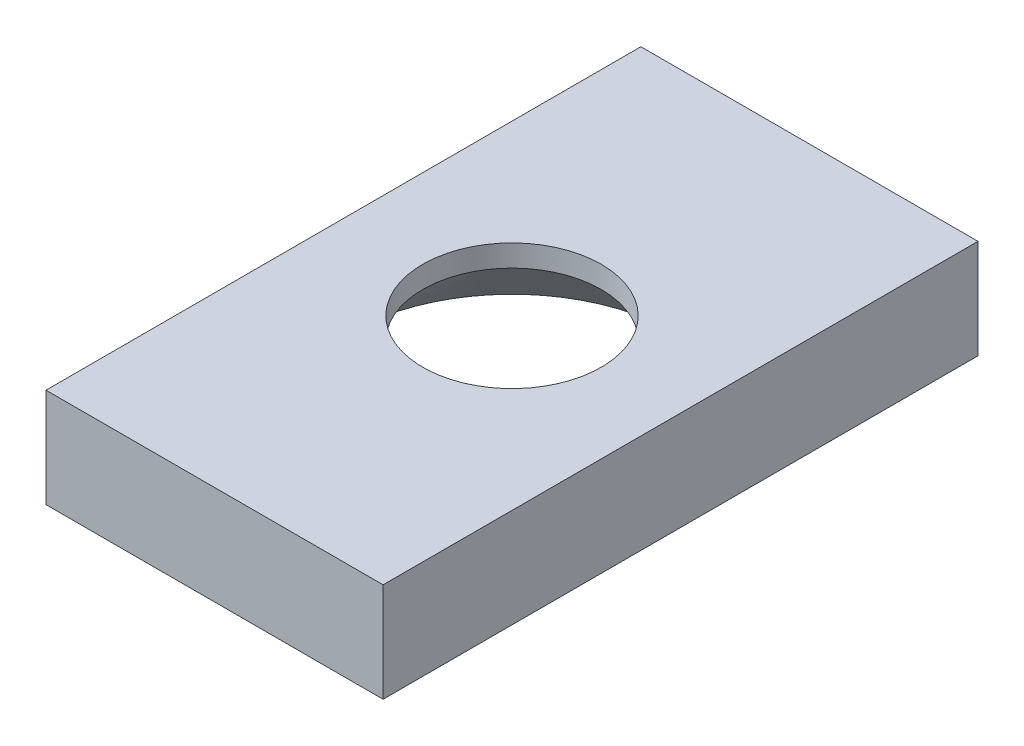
from build123d import *

# Parameters (mm, degrees)
ESQUISSE1_W                                      = 17
ESQUISSE1_H                                      = 5
EXTRUSION1_DEPTH                                 = 30
FRAISAGE_POUR_VIS_T_TE_FRAIS_E_6_PAN_D           = 9
FRAISAGE_POUR_VIS_T_TE_FRAIS_E_6_PAN_DEPTH       = 10
FRAISAGE_POUR_VIS_T_TE_FRAIS_E_6_PAN_CSINK_D     = 16.8
FRAISAGE_POUR_VIS_T_TE_FRAIS_E_6_PAN_CSINK_ANGLE = 90
FRAISAGE_POUR_VIS_T_TE_FRAIS_E_6_PAN_TIP         = 2.703872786


with BuildPart() as part:
    # Esquisse1 → Extrusion1 (new body)
    with BuildSketch(Plane.XY):
        Rectangle(ESQUISSE1_W, ESQUISSE1_H)
    extrude(amount=EXTRUSION1_DEPTH)

    # Fraisage pour vis _ t_te frais_e _ 6 pan
    with Locations(Plane.XZ.offset(2.5)):
        with Locations((0, 15)):
            CounterSinkHole(FRAISAGE_POUR_VIS_T_TE_FRAIS_E_6_PAN_D / 2, FRAISAGE_POUR_VIS_T_TE_FRAIS_E_6_PAN_CSINK_D / 2, depth=FRAISAGE_POUR_VIS_T_TE_FRAIS_E_6_PAN_DEPTH, counter_sink_angle=FRAISAGE_POUR_VIS_T_TE_FRAIS_E_6_PAN_CSINK_ANGLE)
            with Locations((0, 0, -(FRAISAGE_POUR_VIS_T_TE_FRAIS_E_6_PAN_DEPTH + FRAISAGE_POUR_VIS_T_TE_FRAIS_E_6_PAN_TIP / 2))):  # 118° drill point
                Cone(0, FRAISAGE_POUR_VIS_T_TE_FRAIS_E_6_PAN_D / 2, FRAISAGE_POUR_VIS_T_TE_FRAIS_E_6_PAN_TIP, mode=Mode.SUBTRACT)


solid = part.part
